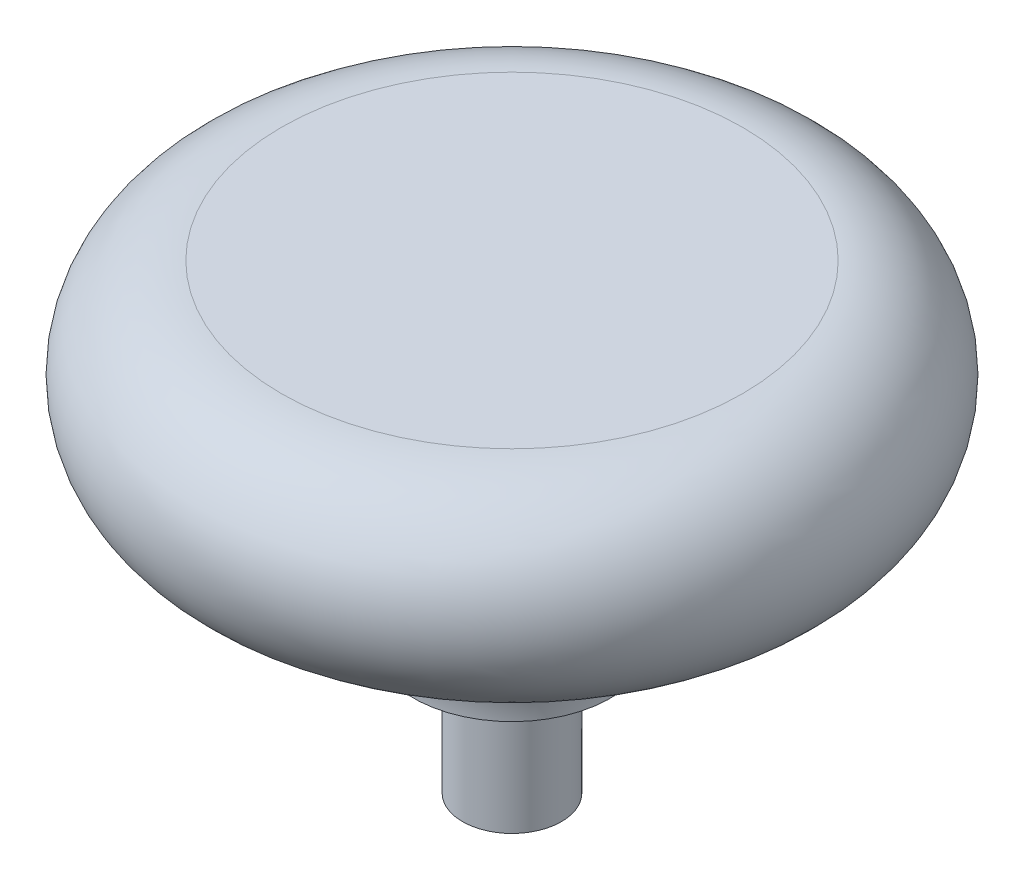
from build123d import *


with BuildPart() as part:
    # Sketch1 → Base-Revolve (revolve)
    with BuildSketch(Plane.XY, mode=Mode.PRIVATE) as base_revolve_sk:
        with BuildLine():
            Line((0, 0), (0, 22.225))
            Line((0, 22.225), (11.1125, 22.225))
            ThreePointArc((11.1125, 22.225), (15.875, 17.4625), (11.1125, 12.7))
            ThreePointArc((11.1125, 12.7), (6.622371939, 10.840128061), (4.7625, 6.35))
            Line((4.7625, 6.35), (2.38125, 6.35))
            Line((2.38125, 6.35), (2.38125, 0))
            Line((2.38125, 0), (0, 0))
        make_face()
    revolve(base_revolve_sk.sketch.rotate(Axis((0, 0, 0), (0, 1, 0)), 90), axis=Axis((0, 0, 0), (0, 1, 0)))


solid = part.part
